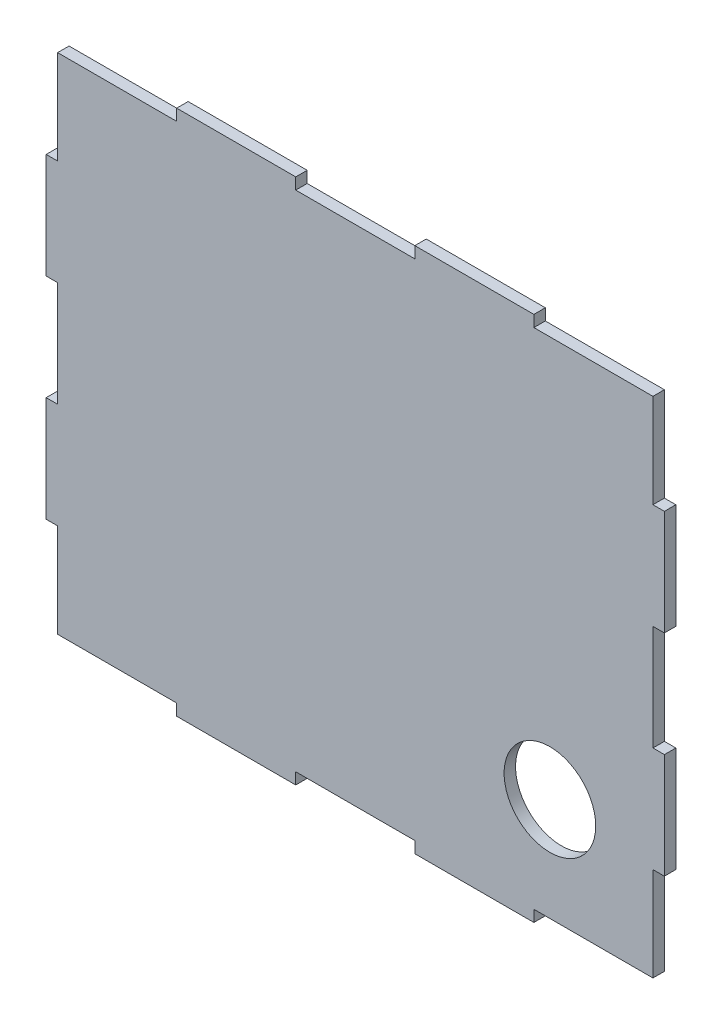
ISO-10303-21;
HEADER;
FILE_DESCRIPTION(('STEP AP214'),'2;1');
FILE_NAME('part.step','',(''),(''),'','','');
FILE_SCHEMA(('AUTOMOTIVE_DESIGN { 1 0 10303 214 1 1 1 1 }'));
ENDSEC;
DATA;
#1=APPLICATION_CONTEXT('core data for automotive mechanical design processes');
#2=APPLICATION_PROTOCOL_DEFINITION('international standard','automotive_design',2000,#1);
#3=PRODUCT_CONTEXT('',#1,'mechanical');
#4=PRODUCT('Part','Part','',(#3));
#5=PRODUCT_RELATED_PRODUCT_CATEGORY('part','',(#4));
#6=PRODUCT_DEFINITION_FORMATION('','',#4);
#7=PRODUCT_DEFINITION_CONTEXT('part definition',#1,'design');
#8=PRODUCT_DEFINITION('design','',#6,#7);
#9=PRODUCT_DEFINITION_SHAPE('','',#8);
#10=(LENGTH_UNIT() NAMED_UNIT(*) SI_UNIT(.MILLI.,.METRE.));
#11=(NAMED_UNIT(*) PLANE_ANGLE_UNIT() SI_UNIT($,.RADIAN.));
#12=(NAMED_UNIT(*) SI_UNIT($,.STERADIAN.) SOLID_ANGLE_UNIT());
#13=UNCERTAINTY_MEASURE_WITH_UNIT(LENGTH_MEASURE(1.E-05),#10,'distance_accuracy_value','');
#14=(GEOMETRIC_REPRESENTATION_CONTEXT(3) GLOBAL_UNCERTAINTY_ASSIGNED_CONTEXT((#13)) GLOBAL_UNIT_ASSIGNED_CONTEXT((#10,
#11,#12)) REPRESENTATION_CONTEXT('',''));
#15=CARTESIAN_POINT('',(0.,0.,0.));
#16=DIRECTION('',(0.,0.,1.));
#17=DIRECTION('',(1.,0.,0.));
#18=AXIS2_PLACEMENT_3D('',#15,#16,#17);
#19=CARTESIAN_POINT('',(3.175,143.234833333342,3.175));
#20=DIRECTION('',(0.,1.,0.));
#21=DIRECTION('',(0.,0.,1.));
#22=AXIS2_PLACEMENT_3D('',#19,#20,#21);
#23=PLANE('',#22);
#24=DIRECTION('',(1.,0.,0.));
#25=VECTOR('',#24,1.);
#26=CARTESIAN_POINT('',(3.175,143.234833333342,0.));
#27=LINE('',#26,#25);
#28=CARTESIAN_POINT('',(3.175,143.234833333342,0.));
#29=VERTEX_POINT('',#28);
#30=CARTESIAN_POINT('',(36.195,143.234833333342,0.));
#31=VERTEX_POINT('',#30);
#32=EDGE_CURVE('E296',#29,#31,#27,.T.);
#33=ORIENTED_EDGE('',*,*,#32,.F.);
#34=DIRECTION('',(0.,0.,-1.));
#35=VECTOR('',#34,1.);
#36=CARTESIAN_POINT('',(3.175,143.234833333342,3.175));
#37=LINE('',#36,#35);
#38=CARTESIAN_POINT('',(3.175,143.234833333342,3.175));
#39=VERTEX_POINT('',#38);
#40=EDGE_CURVE('E11',#39,#29,#37,.T.);
#41=ORIENTED_EDGE('',*,*,#40,.F.);
#42=DIRECTION('',(1.,0.,0.));
#43=VECTOR('',#42,1.);
#44=CARTESIAN_POINT('',(3.175,143.234833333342,3.175));
#45=LINE('',#44,#43);
#46=CARTESIAN_POINT('',(36.195,143.234833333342,3.175));
#47=VERTEX_POINT('',#46);
#48=EDGE_CURVE('E401',#39,#47,#45,.T.);
#49=ORIENTED_EDGE('',*,*,#48,.T.);
#50=DIRECTION('',(0.,0.,-1.));
#51=VECTOR('',#50,1.);
#52=CARTESIAN_POINT('',(36.195,143.234833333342,3.175));
#53=LINE('',#52,#51);
#54=EDGE_CURVE('E34',#47,#31,#53,.T.);
#55=ORIENTED_EDGE('',*,*,#54,.T.);
#56=EDGE_LOOP('',(#33,#41,#49,#55));
#57=FACE_BOUND('',#56,.T.);
#58=ADVANCED_FACE('F31',(#57),#23,.T.);
#59=CARTESIAN_POINT('',(3.175,117.199833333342,3.175));
#60=DIRECTION('',(-1.,0.,0.));
#61=DIRECTION('',(0.,-1.,0.));
#62=AXIS2_PLACEMENT_3D('',#59,#60,#61);
#63=PLANE('',#62);
#64=DIRECTION('',(0.,1.,0.));
#65=VECTOR('',#64,1.);
#66=CARTESIAN_POINT('',(3.175,117.199833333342,0.));
#67=LINE('',#66,#65);
#68=CARTESIAN_POINT('',(3.175,117.199833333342,0.));
#69=VERTEX_POINT('',#68);
#70=EDGE_CURVE('E399',#69,#29,#67,.T.);
#71=ORIENTED_EDGE('',*,*,#70,.F.);
#72=DIRECTION('',(0.,0.,-1.));
#73=VECTOR('',#72,1.);
#74=CARTESIAN_POINT('',(3.175,117.199833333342,3.175));
#75=LINE('',#74,#73);
#76=CARTESIAN_POINT('',(3.175,117.199833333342,3.175));
#77=VERTEX_POINT('',#76);
#78=EDGE_CURVE('E40',#77,#69,#75,.T.);
#79=ORIENTED_EDGE('',*,*,#78,.F.);
#80=DIRECTION('',(0.,1.,0.));
#81=VECTOR('',#80,1.);
#82=CARTESIAN_POINT('',(3.175,117.199833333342,3.175));
#83=LINE('',#82,#81);
#84=EDGE_CURVE('E286',#77,#39,#83,.T.);
#85=ORIENTED_EDGE('',*,*,#84,.T.);
#86=ORIENTED_EDGE('',*,*,#40,.T.);
#87=EDGE_LOOP('',(#71,#79,#85,#86));
#88=FACE_BOUND('',#87,.T.);
#89=ADVANCED_FACE('F469',(#88),#63,.T.);
#90=CARTESIAN_POINT('',(0.,117.199833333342,3.175));
#91=DIRECTION('',(0.,1.,0.));
#92=DIRECTION('',(0.,0.,1.));
#93=AXIS2_PLACEMENT_3D('',#90,#91,#92);
#94=PLANE('',#93);
#95=DIRECTION('',(1.,0.,0.));
#96=VECTOR('',#95,1.);
#97=CARTESIAN_POINT('',(0.,117.199833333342,0.));
#98=LINE('',#97,#96);
#99=CARTESIAN_POINT('',(0.,117.199833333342,0.));
#100=VERTEX_POINT('',#99);
#101=EDGE_CURVE('E273',#100,#69,#98,.T.);
#102=ORIENTED_EDGE('',*,*,#101,.F.);
#103=DIRECTION('',(0.,0.,-1.));
#104=VECTOR('',#103,1.);
#105=CARTESIAN_POINT('',(0.,117.199833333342,3.175));
#106=LINE('',#105,#104);
#107=CARTESIAN_POINT('',(0.,117.199833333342,3.175));
#108=VERTEX_POINT('',#107);
#109=EDGE_CURVE('E268',#108,#100,#106,.T.);
#110=ORIENTED_EDGE('',*,*,#109,.F.);
#111=DIRECTION('',(1.,0.,0.));
#112=VECTOR('',#111,1.);
#113=CARTESIAN_POINT('',(0.,117.199833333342,3.175));
#114=LINE('',#113,#112);
#115=EDGE_CURVE('E271',#108,#77,#114,.T.);
#116=ORIENTED_EDGE('',*,*,#115,.T.);
#117=ORIENTED_EDGE('',*,*,#78,.T.);
#118=EDGE_LOOP('',(#102,#110,#116,#117));
#119=FACE_BOUND('',#118,.T.);
#120=ADVANCED_FACE('F270',(#119),#94,.T.);
#121=CARTESIAN_POINT('',(0.,87.9898333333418,3.175));
#122=DIRECTION('',(-1.,0.,0.));
#123=DIRECTION('',(0.,0.,1.));
#124=AXIS2_PLACEMENT_3D('',#121,#122,#123);
#125=PLANE('',#124);
#126=DIRECTION('',(0.,1.,0.));
#127=VECTOR('',#126,1.);
#128=CARTESIAN_POINT('',(0.,87.9898333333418,0.));
#129=LINE('',#128,#127);
#130=CARTESIAN_POINT('',(0.,87.9898333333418,0.));
#131=VERTEX_POINT('',#130);
#132=EDGE_CURVE('E396',#131,#100,#129,.T.);
#133=ORIENTED_EDGE('',*,*,#132,.F.);
#134=DIRECTION('',(0.,0.,-1.));
#135=VECTOR('',#134,1.);
#136=CARTESIAN_POINT('',(0.,87.9898333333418,3.175));
#137=LINE('',#136,#135);
#138=CARTESIAN_POINT('',(0.,87.9898333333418,3.175));
#139=VERTEX_POINT('',#138);
#140=EDGE_CURVE('E278',#139,#131,#137,.T.);
#141=ORIENTED_EDGE('',*,*,#140,.F.);
#142=DIRECTION('',(0.,1.,0.));
#143=VECTOR('',#142,1.);
#144=CARTESIAN_POINT('',(0.,87.9898333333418,3.175));
#145=LINE('',#144,#143);
#146=EDGE_CURVE('E284',#139,#108,#145,.T.);
#147=ORIENTED_EDGE('',*,*,#146,.T.);
#148=ORIENTED_EDGE('',*,*,#109,.T.);
#149=EDGE_LOOP('',(#133,#141,#147,#148));
#150=FACE_BOUND('',#149,.T.);
#151=ADVANCED_FACE('F288',(#150),#125,.T.);
#152=CARTESIAN_POINT('',(3.175,87.9898333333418,3.175));
#153=DIRECTION('',(0.,-1.,0.));
#154=DIRECTION('',(0.,0.,-1.));
#155=AXIS2_PLACEMENT_3D('',#152,#153,#154);
#156=PLANE('',#155);
#157=DIRECTION('',(-1.,0.,0.));
#158=VECTOR('',#157,1.);
#159=CARTESIAN_POINT('',(3.175,87.9898333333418,0.));
#160=LINE('',#159,#158);
#161=CARTESIAN_POINT('',(3.175,87.9898333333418,0.));
#162=VERTEX_POINT('',#161);
#163=EDGE_CURVE('E393',#162,#131,#160,.T.);
#164=ORIENTED_EDGE('',*,*,#163,.F.);
#165=DIRECTION('',(0.,0.,-1.));
#166=VECTOR('',#165,1.);
#167=CARTESIAN_POINT('',(3.175,87.9898333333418,3.175));
#168=LINE('',#167,#166);
#169=CARTESIAN_POINT('',(3.175,87.9898333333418,3.175));
#170=VERTEX_POINT('',#169);
#171=EDGE_CURVE('E405',#170,#162,#168,.T.);
#172=ORIENTED_EDGE('',*,*,#171,.F.);
#173=DIRECTION('',(-1.,0.,0.));
#174=VECTOR('',#173,1.);
#175=CARTESIAN_POINT('',(3.175,87.9898333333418,3.175));
#176=LINE('',#175,#174);
#177=EDGE_CURVE('E289',#170,#139,#176,.T.);
#178=ORIENTED_EDGE('',*,*,#177,.T.);
#179=ORIENTED_EDGE('',*,*,#140,.T.);
#180=EDGE_LOOP('',(#164,#172,#178,#179));
#181=FACE_BOUND('',#180,.T.);
#182=ADVANCED_FACE('F482',(#181),#156,.T.);
#183=CARTESIAN_POINT('',(3.175,58.7798333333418,3.175));
#184=DIRECTION('',(-1.,0.,0.));
#185=DIRECTION('',(0.,0.,1.));
#186=AXIS2_PLACEMENT_3D('',#183,#184,#185);
#187=PLANE('',#186);
#188=DIRECTION('',(0.,1.,0.));
#189=VECTOR('',#188,1.);
#190=CARTESIAN_POINT('',(3.175,58.7798333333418,0.));
#191=LINE('',#190,#189);
#192=CARTESIAN_POINT('',(3.175,58.7798333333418,0.));
#193=VERTEX_POINT('',#192);
#194=EDGE_CURVE('E390',#193,#162,#191,.T.);
#195=ORIENTED_EDGE('',*,*,#194,.F.);
#196=DIRECTION('',(0.,0.,-1.));
#197=VECTOR('',#196,1.);
#198=CARTESIAN_POINT('',(3.175,58.7798333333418,3.175));
#199=LINE('',#198,#197);
#200=CARTESIAN_POINT('',(3.175,58.7798333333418,3.175));
#201=VERTEX_POINT('',#200);
#202=EDGE_CURVE('E407',#201,#193,#199,.T.);
#203=ORIENTED_EDGE('',*,*,#202,.F.);
#204=DIRECTION('',(0.,1.,0.));
#205=VECTOR('',#204,1.);
#206=CARTESIAN_POINT('',(3.175,58.7798333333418,3.175));
#207=LINE('',#206,#205);
#208=EDGE_CURVE('E291',#201,#170,#207,.T.);
#209=ORIENTED_EDGE('',*,*,#208,.T.);
#210=ORIENTED_EDGE('',*,*,#171,.T.);
#211=EDGE_LOOP('',(#195,#203,#209,#210));
#212=FACE_BOUND('',#211,.T.);
#213=ADVANCED_FACE('F485',(#212),#187,.T.);
#214=CARTESIAN_POINT('',(0.,58.7798333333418,3.175));
#215=DIRECTION('',(0.,1.,0.));
#216=DIRECTION('',(0.,0.,1.));
#217=AXIS2_PLACEMENT_3D('',#214,#215,#216);
#218=PLANE('',#217);
#219=DIRECTION('',(1.,0.,0.));
#220=VECTOR('',#219,1.);
#221=CARTESIAN_POINT('',(0.,58.7798333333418,0.));
#222=LINE('',#221,#220);
#223=CARTESIAN_POINT('',(0.,58.7798333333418,0.));
#224=VERTEX_POINT('',#223);
#225=EDGE_CURVE('E387',#224,#193,#222,.T.);
#226=ORIENTED_EDGE('',*,*,#225,.F.);
#227=DIRECTION('',(0.,0.,-1.));
#228=VECTOR('',#227,1.);
#229=CARTESIAN_POINT('',(0.,58.7798333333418,3.175));
#230=LINE('',#229,#228);
#231=CARTESIAN_POINT('',(0.,58.7798333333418,3.175));
#232=VERTEX_POINT('',#231);
#233=EDGE_CURVE('E409',#232,#224,#230,.T.);
#234=ORIENTED_EDGE('',*,*,#233,.F.);
#235=DIRECTION('',(1.,0.,0.));
#236=VECTOR('',#235,1.);
#237=CARTESIAN_POINT('',(0.,58.7798333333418,3.175));
#238=LINE('',#237,#236);
#239=EDGE_CURVE('E716',#232,#201,#238,.T.);
#240=ORIENTED_EDGE('',*,*,#239,.T.);
#241=ORIENTED_EDGE('',*,*,#202,.T.);
#242=EDGE_LOOP('',(#226,#234,#240,#241));
#243=FACE_BOUND('',#242,.T.);
#244=ADVANCED_FACE('F489',(#243),#218,.T.);
#245=CARTESIAN_POINT('',(0.,29.5698333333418,3.175));
#246=DIRECTION('',(-1.,0.,0.));
#247=DIRECTION('',(0.,0.,1.));
#248=AXIS2_PLACEMENT_3D('',#245,#246,#247);
#249=PLANE('',#248);
#250=DIRECTION('',(0.,1.,0.));
#251=VECTOR('',#250,1.);
#252=CARTESIAN_POINT('',(0.,29.5698333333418,0.));
#253=LINE('',#252,#251);
#254=CARTESIAN_POINT('',(0.,29.5698333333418,0.));
#255=VERTEX_POINT('',#254);
#256=EDGE_CURVE('E384',#255,#224,#253,.T.);
#257=ORIENTED_EDGE('',*,*,#256,.F.);
#258=DIRECTION('',(0.,0.,-1.));
#259=VECTOR('',#258,1.);
#260=CARTESIAN_POINT('',(0.,29.5698333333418,3.175));
#261=LINE('',#260,#259);
#262=CARTESIAN_POINT('',(0.,29.5698333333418,3.175));
#263=VERTEX_POINT('',#262);
#264=EDGE_CURVE('E411',#263,#255,#261,.T.);
#265=ORIENTED_EDGE('',*,*,#264,.F.);
#266=DIRECTION('',(0.,1.,0.));
#267=VECTOR('',#266,1.);
#268=CARTESIAN_POINT('',(0.,29.5698333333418,3.175));
#269=LINE('',#268,#267);
#270=EDGE_CURVE('E713',#263,#232,#269,.T.);
#271=ORIENTED_EDGE('',*,*,#270,.T.);
#272=ORIENTED_EDGE('',*,*,#233,.T.);
#273=EDGE_LOOP('',(#257,#265,#271,#272));
#274=FACE_BOUND('',#273,.T.);
#275=ADVANCED_FACE('F493',(#274),#249,.T.);
#276=CARTESIAN_POINT('',(3.175,29.5698333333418,3.175));
#277=DIRECTION('',(0.,-1.,0.));
#278=DIRECTION('',(0.,0.,-1.));
#279=AXIS2_PLACEMENT_3D('',#276,#277,#278);
#280=PLANE('',#279);
#281=DIRECTION('',(-1.,0.,0.));
#282=VECTOR('',#281,1.);
#283=CARTESIAN_POINT('',(3.175,29.5698333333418,0.));
#284=LINE('',#283,#282);
#285=CARTESIAN_POINT('',(3.175,29.5698333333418,0.));
#286=VERTEX_POINT('',#285);
#287=EDGE_CURVE('E381',#286,#255,#284,.T.);
#288=ORIENTED_EDGE('',*,*,#287,.F.);
#289=DIRECTION('',(0.,0.,-1.));
#290=VECTOR('',#289,1.);
#291=CARTESIAN_POINT('',(3.175,29.5698333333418,3.175));
#292=LINE('',#291,#290);
#293=CARTESIAN_POINT('',(3.175,29.5698333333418,3.175));
#294=VERTEX_POINT('',#293);
#295=EDGE_CURVE('E413',#294,#286,#292,.T.);
#296=ORIENTED_EDGE('',*,*,#295,.F.);
#297=DIRECTION('',(-1.,0.,0.));
#298=VECTOR('',#297,1.);
#299=CARTESIAN_POINT('',(3.175,29.5698333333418,3.175));
#300=LINE('',#299,#298);
#301=EDGE_CURVE('E710',#294,#263,#300,.T.);
#302=ORIENTED_EDGE('',*,*,#301,.T.);
#303=ORIENTED_EDGE('',*,*,#264,.T.);
#304=EDGE_LOOP('',(#288,#296,#302,#303));
#305=FACE_BOUND('',#304,.T.);
#306=ADVANCED_FACE('F497',(#305),#280,.T.);
#307=CARTESIAN_POINT('',(3.175,3.53483333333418,3.175));
#308=DIRECTION('',(-1.,0.,0.));
#309=DIRECTION('',(0.,0.,1.));
#310=AXIS2_PLACEMENT_3D('',#307,#308,#309);
#311=PLANE('',#310);
#312=DIRECTION('',(0.,1.,0.));
#313=VECTOR('',#312,1.);
#314=CARTESIAN_POINT('',(3.175,3.53483333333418,0.));
#315=LINE('',#314,#313);
#316=CARTESIAN_POINT('',(3.175,3.53483333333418,0.));
#317=VERTEX_POINT('',#316);
#318=EDGE_CURVE('E378',#317,#286,#315,.T.);
#319=ORIENTED_EDGE('',*,*,#318,.F.);
#320=DIRECTION('',(0.,0.,-1.));
#321=VECTOR('',#320,1.);
#322=CARTESIAN_POINT('',(3.175,3.53483333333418,3.175));
#323=LINE('',#322,#321);
#324=CARTESIAN_POINT('',(3.175,3.53483333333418,3.175));
#325=VERTEX_POINT('',#324);
#326=EDGE_CURVE('E415',#325,#317,#323,.T.);
#327=ORIENTED_EDGE('',*,*,#326,.F.);
#328=DIRECTION('',(0.,1.,0.));
#329=VECTOR('',#328,1.);
#330=CARTESIAN_POINT('',(3.175,3.53483333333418,3.175));
#331=LINE('',#330,#329);
#332=EDGE_CURVE('E707',#325,#294,#331,.T.);
#333=ORIENTED_EDGE('',*,*,#332,.T.);
#334=ORIENTED_EDGE('',*,*,#295,.T.);
#335=EDGE_LOOP('',(#319,#327,#333,#334));
#336=FACE_BOUND('',#335,.T.);
#337=ADVANCED_FACE('F501',(#336),#311,.T.);
#338=CARTESIAN_POINT('',(36.195,3.53483333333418,3.175));
#339=DIRECTION('',(0.,-1.,0.));
#340=DIRECTION('',(1.,0.,0.));
#341=AXIS2_PLACEMENT_3D('',#338,#339,#340);
#342=PLANE('',#341);
#343=DIRECTION('',(-1.,0.,0.));
#344=VECTOR('',#343,1.);
#345=CARTESIAN_POINT('',(36.195,3.53483333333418,0.));
#346=LINE('',#345,#344);
#347=CARTESIAN_POINT('',(36.195,3.53483333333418,0.));
#348=VERTEX_POINT('',#347);
#349=EDGE_CURVE('E375',#348,#317,#346,.T.);
#350=ORIENTED_EDGE('',*,*,#349,.F.);
#351=DIRECTION('',(0.,0.,-1.));
#352=VECTOR('',#351,1.);
#353=CARTESIAN_POINT('',(36.195,3.53483333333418,3.175));
#354=LINE('',#353,#352);
#355=CARTESIAN_POINT('',(36.195,3.53483333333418,3.175));
#356=VERTEX_POINT('',#355);
#357=EDGE_CURVE('E417',#356,#348,#354,.T.);
#358=ORIENTED_EDGE('',*,*,#357,.F.);
#359=DIRECTION('',(-1.,0.,0.));
#360=VECTOR('',#359,1.);
#361=CARTESIAN_POINT('',(36.195,3.53483333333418,3.175));
#362=LINE('',#361,#360);
#363=EDGE_CURVE('E704',#356,#325,#362,.T.);
#364=ORIENTED_EDGE('',*,*,#363,.T.);
#365=ORIENTED_EDGE('',*,*,#326,.T.);
#366=EDGE_LOOP('',(#350,#358,#364,#365));
#367=FACE_BOUND('',#366,.T.);
#368=ADVANCED_FACE('F505',(#367),#342,.T.);
#369=CARTESIAN_POINT('',(36.195,0.359833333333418,3.175));
#370=DIRECTION('',(-1.,0.,0.));
#371=DIRECTION('',(0.,0.,1.));
#372=AXIS2_PLACEMENT_3D('',#369,#370,#371);
#373=PLANE('',#372);
#374=DIRECTION('',(0.,1.,0.));
#375=VECTOR('',#374,1.);
#376=CARTESIAN_POINT('',(36.195,0.359833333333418,0.));
#377=LINE('',#376,#375);
#378=CARTESIAN_POINT('',(36.195,0.359833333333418,0.));
#379=VERTEX_POINT('',#378);
#380=EDGE_CURVE('E372',#379,#348,#377,.T.);
#381=ORIENTED_EDGE('',*,*,#380,.F.);
#382=DIRECTION('',(0.,0.,-1.));
#383=VECTOR('',#382,1.);
#384=CARTESIAN_POINT('',(36.195,0.359833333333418,3.175));
#385=LINE('',#384,#383);
#386=CARTESIAN_POINT('',(36.195,0.359833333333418,3.175));
#387=VERTEX_POINT('',#386);
#388=EDGE_CURVE('E419',#387,#379,#385,.T.);
#389=ORIENTED_EDGE('',*,*,#388,.F.);
#390=DIRECTION('',(0.,1.,0.));
#391=VECTOR('',#390,1.);
#392=CARTESIAN_POINT('',(36.195,0.359833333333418,3.175));
#393=LINE('',#392,#391);
#394=EDGE_CURVE('E701',#387,#356,#393,.T.);
#395=ORIENTED_EDGE('',*,*,#394,.T.);
#396=ORIENTED_EDGE('',*,*,#357,.T.);
#397=EDGE_LOOP('',(#381,#389,#395,#396));
#398=FACE_BOUND('',#397,.T.);
#399=ADVANCED_FACE('F509',(#398),#373,.T.);
#400=CARTESIAN_POINT('',(69.215,0.359833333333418,3.175));
#401=DIRECTION('',(0.,-1.,0.));
#402=DIRECTION('',(1.,0.,0.));
#403=AXIS2_PLACEMENT_3D('',#400,#401,#402);
#404=PLANE('',#403);
#405=DIRECTION('',(-1.,0.,0.));
#406=VECTOR('',#405,1.);
#407=CARTESIAN_POINT('',(69.215,0.359833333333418,0.));
#408=LINE('',#407,#406);
#409=CARTESIAN_POINT('',(69.215,0.359833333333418,0.));
#410=VERTEX_POINT('',#409);
#411=EDGE_CURVE('E369',#410,#379,#408,.T.);
#412=ORIENTED_EDGE('',*,*,#411,.F.);
#413=DIRECTION('',(0.,0.,-1.));
#414=VECTOR('',#413,1.);
#415=CARTESIAN_POINT('',(69.215,0.359833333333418,3.175));
#416=LINE('',#415,#414);
#417=CARTESIAN_POINT('',(69.215,0.359833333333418,3.175));
#418=VERTEX_POINT('',#417);
#419=EDGE_CURVE('E421',#418,#410,#416,.T.);
#420=ORIENTED_EDGE('',*,*,#419,.F.);
#421=DIRECTION('',(-1.,0.,0.));
#422=VECTOR('',#421,1.);
#423=CARTESIAN_POINT('',(69.215,0.359833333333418,3.175));
#424=LINE('',#423,#422);
#425=EDGE_CURVE('E698',#418,#387,#424,.T.);
#426=ORIENTED_EDGE('',*,*,#425,.T.);
#427=ORIENTED_EDGE('',*,*,#388,.T.);
#428=EDGE_LOOP('',(#412,#420,#426,#427));
#429=FACE_BOUND('',#428,.T.);
#430=ADVANCED_FACE('F513',(#429),#404,.T.);
#431=CARTESIAN_POINT('',(69.215,3.53483333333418,3.175));
#432=DIRECTION('',(1.,0.,0.));
#433=DIRECTION('',(0.,0.,-1.));
#434=AXIS2_PLACEMENT_3D('',#431,#432,#433);
#435=PLANE('',#434);
#436=DIRECTION('',(0.,-1.,0.));
#437=VECTOR('',#436,1.);
#438=CARTESIAN_POINT('',(69.215,3.53483333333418,0.));
#439=LINE('',#438,#437);
#440=CARTESIAN_POINT('',(69.215,3.53483333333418,0.));
#441=VERTEX_POINT('',#440);
#442=EDGE_CURVE('E366',#441,#410,#439,.T.);
#443=ORIENTED_EDGE('',*,*,#442,.F.);
#444=DIRECTION('',(0.,0.,-1.));
#445=VECTOR('',#444,1.);
#446=CARTESIAN_POINT('',(69.215,3.53483333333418,3.175));
#447=LINE('',#446,#445);
#448=CARTESIAN_POINT('',(69.215,3.53483333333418,3.175));
#449=VERTEX_POINT('',#448);
#450=EDGE_CURVE('E423',#449,#441,#447,.T.);
#451=ORIENTED_EDGE('',*,*,#450,.F.);
#452=DIRECTION('',(0.,-1.,0.));
#453=VECTOR('',#452,1.);
#454=CARTESIAN_POINT('',(69.215,3.53483333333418,3.175));
#455=LINE('',#454,#453);
#456=EDGE_CURVE('E695',#449,#418,#455,.T.);
#457=ORIENTED_EDGE('',*,*,#456,.T.);
#458=ORIENTED_EDGE('',*,*,#419,.T.);
#459=EDGE_LOOP('',(#443,#451,#457,#458));
#460=FACE_BOUND('',#459,.T.);
#461=ADVANCED_FACE('F517',(#460),#435,.T.);
#462=CARTESIAN_POINT('',(102.235,3.53483333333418,3.175));
#463=DIRECTION('',(0.,-1.,0.));
#464=DIRECTION('',(0.,0.,-1.));
#465=AXIS2_PLACEMENT_3D('',#462,#463,#464);
#466=PLANE('',#465);
#467=DIRECTION('',(-1.,0.,0.));
#468=VECTOR('',#467,1.);
#469=CARTESIAN_POINT('',(102.235,3.53483333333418,0.));
#470=LINE('',#469,#468);
#471=CARTESIAN_POINT('',(102.235,3.53483333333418,0.));
#472=VERTEX_POINT('',#471);
#473=EDGE_CURVE('E363',#472,#441,#470,.T.);
#474=ORIENTED_EDGE('',*,*,#473,.F.);
#475=DIRECTION('',(0.,0.,-1.));
#476=VECTOR('',#475,1.);
#477=CARTESIAN_POINT('',(102.235,3.53483333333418,3.175));
#478=LINE('',#477,#476);
#479=CARTESIAN_POINT('',(102.235,3.53483333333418,3.175));
#480=VERTEX_POINT('',#479);
#481=EDGE_CURVE('E425',#480,#472,#478,.T.);
#482=ORIENTED_EDGE('',*,*,#481,.F.);
#483=DIRECTION('',(-1.,0.,0.));
#484=VECTOR('',#483,1.);
#485=CARTESIAN_POINT('',(102.235,3.53483333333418,3.175));
#486=LINE('',#485,#484);
#487=EDGE_CURVE('E692',#480,#449,#486,.T.);
#488=ORIENTED_EDGE('',*,*,#487,.T.);
#489=ORIENTED_EDGE('',*,*,#450,.T.);
#490=EDGE_LOOP('',(#474,#482,#488,#489));
#491=FACE_BOUND('',#490,.T.);
#492=ADVANCED_FACE('F521',(#491),#466,.T.);
#493=CARTESIAN_POINT('',(102.235,0.359833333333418,3.175));
#494=DIRECTION('',(-1.,0.,0.));
#495=DIRECTION('',(0.,0.,1.));
#496=AXIS2_PLACEMENT_3D('',#493,#494,#495);
#497=PLANE('',#496);
#498=DIRECTION('',(0.,1.,0.));
#499=VECTOR('',#498,1.);
#500=CARTESIAN_POINT('',(102.235,0.359833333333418,0.));
#501=LINE('',#500,#499);
#502=CARTESIAN_POINT('',(102.235,0.359833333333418,0.));
#503=VERTEX_POINT('',#502);
#504=EDGE_CURVE('E360',#503,#472,#501,.T.);
#505=ORIENTED_EDGE('',*,*,#504,.F.);
#506=DIRECTION('',(0.,0.,-1.));
#507=VECTOR('',#506,1.);
#508=CARTESIAN_POINT('',(102.235,0.359833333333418,3.175));
#509=LINE('',#508,#507);
#510=CARTESIAN_POINT('',(102.235,0.359833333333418,3.175));
#511=VERTEX_POINT('',#510);
#512=EDGE_CURVE('E427',#511,#503,#509,.T.);
#513=ORIENTED_EDGE('',*,*,#512,.F.);
#514=DIRECTION('',(0.,1.,0.));
#515=VECTOR('',#514,1.);
#516=CARTESIAN_POINT('',(102.235,0.359833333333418,3.175));
#517=LINE('',#516,#515);
#518=EDGE_CURVE('E689',#511,#480,#517,.T.);
#519=ORIENTED_EDGE('',*,*,#518,.T.);
#520=ORIENTED_EDGE('',*,*,#481,.T.);
#521=EDGE_LOOP('',(#505,#513,#519,#520));
#522=FACE_BOUND('',#521,.T.);
#523=ADVANCED_FACE('F525',(#522),#497,.T.);
#524=CARTESIAN_POINT('',(135.255,0.359833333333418,3.175));
#525=DIRECTION('',(0.,-1.,0.));
#526=DIRECTION('',(1.,0.,0.));
#527=AXIS2_PLACEMENT_3D('',#524,#525,#526);
#528=PLANE('',#527);
#529=DIRECTION('',(-1.,0.,0.));
#530=VECTOR('',#529,1.);
#531=CARTESIAN_POINT('',(135.255,0.359833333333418,0.));
#532=LINE('',#531,#530);
#533=CARTESIAN_POINT('',(135.255,0.359833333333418,0.));
#534=VERTEX_POINT('',#533);
#535=EDGE_CURVE('E357',#534,#503,#532,.T.);
#536=ORIENTED_EDGE('',*,*,#535,.F.);
#537=DIRECTION('',(0.,0.,-1.));
#538=VECTOR('',#537,1.);
#539=CARTESIAN_POINT('',(135.255,0.359833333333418,3.175));
#540=LINE('',#539,#538);
#541=CARTESIAN_POINT('',(135.255,0.359833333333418,3.175));
#542=VERTEX_POINT('',#541);
#543=EDGE_CURVE('E429',#542,#534,#540,.T.);
#544=ORIENTED_EDGE('',*,*,#543,.F.);
#545=DIRECTION('',(-1.,0.,0.));
#546=VECTOR('',#545,1.);
#547=CARTESIAN_POINT('',(135.255,0.359833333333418,3.175));
#548=LINE('',#547,#546);
#549=EDGE_CURVE('E686',#542,#511,#548,.T.);
#550=ORIENTED_EDGE('',*,*,#549,.T.);
#551=ORIENTED_EDGE('',*,*,#512,.T.);
#552=EDGE_LOOP('',(#536,#544,#550,#551));
#553=FACE_BOUND('',#552,.T.);
#554=ADVANCED_FACE('F529',(#553),#528,.T.);
#555=CARTESIAN_POINT('',(135.255,3.53483333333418,3.175));
#556=DIRECTION('',(1.,0.,0.));
#557=DIRECTION('',(0.,0.,-1.));
#558=AXIS2_PLACEMENT_3D('',#555,#556,#557);
#559=PLANE('',#558);
#560=DIRECTION('',(0.,-1.,0.));
#561=VECTOR('',#560,1.);
#562=CARTESIAN_POINT('',(135.255,3.53483333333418,0.));
#563=LINE('',#562,#561);
#564=CARTESIAN_POINT('',(135.255,3.53483333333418,0.));
#565=VERTEX_POINT('',#564);
#566=EDGE_CURVE('E354',#565,#534,#563,.T.);
#567=ORIENTED_EDGE('',*,*,#566,.F.);
#568=DIRECTION('',(0.,0.,-1.));
#569=VECTOR('',#568,1.);
#570=CARTESIAN_POINT('',(135.255,3.53483333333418,3.175));
#571=LINE('',#570,#569);
#572=CARTESIAN_POINT('',(135.255,3.53483333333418,3.175));
#573=VERTEX_POINT('',#572);
#574=EDGE_CURVE('E431',#573,#565,#571,.T.);
#575=ORIENTED_EDGE('',*,*,#574,.F.);
#576=DIRECTION('',(0.,-1.,0.));
#577=VECTOR('',#576,1.);
#578=CARTESIAN_POINT('',(135.255,3.53483333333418,3.175));
#579=LINE('',#578,#577);
#580=EDGE_CURVE('E683',#573,#542,#579,.T.);
#581=ORIENTED_EDGE('',*,*,#580,.T.);
#582=ORIENTED_EDGE('',*,*,#543,.T.);
#583=EDGE_LOOP('',(#567,#575,#581,#582));
#584=FACE_BOUND('',#583,.T.);
#585=ADVANCED_FACE('F533',(#584),#559,.T.);
#586=CARTESIAN_POINT('',(168.275,3.53483333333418,3.175));
#587=DIRECTION('',(0.,-1.,0.));
#588=DIRECTION('',(0.,0.,-1.));
#589=AXIS2_PLACEMENT_3D('',#586,#587,#588);
#590=PLANE('',#589);
#591=DIRECTION('',(-1.,0.,0.));
#592=VECTOR('',#591,1.);
#593=CARTESIAN_POINT('',(168.275,3.53483333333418,0.));
#594=LINE('',#593,#592);
#595=CARTESIAN_POINT('',(168.275,3.53483333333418,0.));
#596=VERTEX_POINT('',#595);
#597=EDGE_CURVE('E351',#596,#565,#594,.T.);
#598=ORIENTED_EDGE('',*,*,#597,.F.);
#599=DIRECTION('',(0.,0.,-1.));
#600=VECTOR('',#599,1.);
#601=CARTESIAN_POINT('',(168.275,3.53483333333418,3.175));
#602=LINE('',#601,#600);
#603=CARTESIAN_POINT('',(168.275,3.53483333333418,3.175));
#604=VERTEX_POINT('',#603);
#605=EDGE_CURVE('E433',#604,#596,#602,.T.);
#606=ORIENTED_EDGE('',*,*,#605,.F.);
#607=DIRECTION('',(-1.,0.,0.));
#608=VECTOR('',#607,1.);
#609=CARTESIAN_POINT('',(168.275,3.53483333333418,3.175));
#610=LINE('',#609,#608);
#611=EDGE_CURVE('E680',#604,#573,#610,.T.);
#612=ORIENTED_EDGE('',*,*,#611,.T.);
#613=ORIENTED_EDGE('',*,*,#574,.T.);
#614=EDGE_LOOP('',(#598,#606,#612,#613));
#615=FACE_BOUND('',#614,.T.);
#616=ADVANCED_FACE('F537',(#615),#590,.T.);
#617=CARTESIAN_POINT('',(168.275,29.5698333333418,3.175));
#618=DIRECTION('',(1.,0.,0.));
#619=DIRECTION('',(0.,0.,-1.));
#620=AXIS2_PLACEMENT_3D('',#617,#618,#619);
#621=PLANE('',#620);
#622=DIRECTION('',(0.,-1.,0.));
#623=VECTOR('',#622,1.);
#624=CARTESIAN_POINT('',(168.275,29.5698333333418,0.));
#625=LINE('',#624,#623);
#626=CARTESIAN_POINT('',(168.275,29.5698333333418,0.));
#627=VERTEX_POINT('',#626);
#628=EDGE_CURVE('E348',#627,#596,#625,.T.);
#629=ORIENTED_EDGE('',*,*,#628,.F.);
#630=DIRECTION('',(0.,0.,-1.));
#631=VECTOR('',#630,1.);
#632=CARTESIAN_POINT('',(168.275,29.5698333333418,3.175));
#633=LINE('',#632,#631);
#634=CARTESIAN_POINT('',(168.275,29.5698333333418,3.175));
#635=VERTEX_POINT('',#634);
#636=EDGE_CURVE('E435',#635,#627,#633,.T.);
#637=ORIENTED_EDGE('',*,*,#636,.F.);
#638=DIRECTION('',(0.,-1.,0.));
#639=VECTOR('',#638,1.);
#640=CARTESIAN_POINT('',(168.275,29.5698333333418,3.175));
#641=LINE('',#640,#639);
#642=EDGE_CURVE('E677',#635,#604,#641,.T.);
#643=ORIENTED_EDGE('',*,*,#642,.T.);
#644=ORIENTED_EDGE('',*,*,#605,.T.);
#645=EDGE_LOOP('',(#629,#637,#643,#644));
#646=FACE_BOUND('',#645,.T.);
#647=ADVANCED_FACE('F541',(#646),#621,.T.);
#648=CARTESIAN_POINT('',(171.45,29.5698333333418,3.175));
#649=DIRECTION('',(0.,-1.,0.));
#650=DIRECTION('',(0.,0.,-1.));
#651=AXIS2_PLACEMENT_3D('',#648,#649,#650);
#652=PLANE('',#651);
#653=DIRECTION('',(-1.,0.,0.));
#654=VECTOR('',#653,1.);
#655=CARTESIAN_POINT('',(171.45,29.5698333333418,0.));
#656=LINE('',#655,#654);
#657=CARTESIAN_POINT('',(171.45,29.5698333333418,0.));
#658=VERTEX_POINT('',#657);
#659=EDGE_CURVE('E345',#658,#627,#656,.T.);
#660=ORIENTED_EDGE('',*,*,#659,.F.);
#661=DIRECTION('',(0.,0.,-1.));
#662=VECTOR('',#661,1.);
#663=CARTESIAN_POINT('',(171.45,29.5698333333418,3.175));
#664=LINE('',#663,#662);
#665=CARTESIAN_POINT('',(171.45,29.5698333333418,3.175));
#666=VERTEX_POINT('',#665);
#667=EDGE_CURVE('E437',#666,#658,#664,.T.);
#668=ORIENTED_EDGE('',*,*,#667,.F.);
#669=DIRECTION('',(-1.,0.,0.));
#670=VECTOR('',#669,1.);
#671=CARTESIAN_POINT('',(171.45,29.5698333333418,3.175));
#672=LINE('',#671,#670);
#673=EDGE_CURVE('E674',#666,#635,#672,.T.);
#674=ORIENTED_EDGE('',*,*,#673,.T.);
#675=ORIENTED_EDGE('',*,*,#636,.T.);
#676=EDGE_LOOP('',(#660,#668,#674,#675));
#677=FACE_BOUND('',#676,.T.);
#678=ADVANCED_FACE('F545',(#677),#652,.T.);
#679=CARTESIAN_POINT('',(171.45,58.7798333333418,3.175));
#680=DIRECTION('',(1.,0.,0.));
#681=DIRECTION('',(0.,0.,-1.));
#682=AXIS2_PLACEMENT_3D('',#679,#680,#681);
#683=PLANE('',#682);
#684=DIRECTION('',(0.,-1.,0.));
#685=VECTOR('',#684,1.);
#686=CARTESIAN_POINT('',(171.45,58.7798333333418,0.));
#687=LINE('',#686,#685);
#688=CARTESIAN_POINT('',(171.45,58.7798333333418,0.));
#689=VERTEX_POINT('',#688);
#690=EDGE_CURVE('E342',#689,#658,#687,.T.);
#691=ORIENTED_EDGE('',*,*,#690,.F.);
#692=DIRECTION('',(0.,0.,-1.));
#693=VECTOR('',#692,1.);
#694=CARTESIAN_POINT('',(171.45,58.7798333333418,3.175));
#695=LINE('',#694,#693);
#696=CARTESIAN_POINT('',(171.45,58.7798333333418,3.175));
#697=VERTEX_POINT('',#696);
#698=EDGE_CURVE('E439',#697,#689,#695,.T.);
#699=ORIENTED_EDGE('',*,*,#698,.F.);
#700=DIRECTION('',(0.,-1.,0.));
#701=VECTOR('',#700,1.);
#702=CARTESIAN_POINT('',(171.45,58.7798333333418,3.175));
#703=LINE('',#702,#701);
#704=EDGE_CURVE('E671',#697,#666,#703,.T.);
#705=ORIENTED_EDGE('',*,*,#704,.T.);
#706=ORIENTED_EDGE('',*,*,#667,.T.);
#707=EDGE_LOOP('',(#691,#699,#705,#706));
#708=FACE_BOUND('',#707,.T.);
#709=ADVANCED_FACE('F549',(#708),#683,.T.);
#710=CARTESIAN_POINT('',(168.275,58.7798333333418,3.175));
#711=DIRECTION('',(0.,1.,0.));
#712=DIRECTION('',(0.,0.,1.));
#713=AXIS2_PLACEMENT_3D('',#710,#711,#712);
#714=PLANE('',#713);
#715=DIRECTION('',(1.,0.,0.));
#716=VECTOR('',#715,1.);
#717=CARTESIAN_POINT('',(168.275,58.7798333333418,0.));
#718=LINE('',#717,#716);
#719=CARTESIAN_POINT('',(168.275,58.7798333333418,0.));
#720=VERTEX_POINT('',#719);
#721=EDGE_CURVE('E339',#720,#689,#718,.T.);
#722=ORIENTED_EDGE('',*,*,#721,.F.);
#723=DIRECTION('',(0.,0.,-1.));
#724=VECTOR('',#723,1.);
#725=CARTESIAN_POINT('',(168.275,58.7798333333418,3.175));
#726=LINE('',#725,#724);
#727=CARTESIAN_POINT('',(168.275,58.7798333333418,3.175));
#728=VERTEX_POINT('',#727);
#729=EDGE_CURVE('E441',#728,#720,#726,.T.);
#730=ORIENTED_EDGE('',*,*,#729,.F.);
#731=DIRECTION('',(1.,0.,0.));
#732=VECTOR('',#731,1.);
#733=CARTESIAN_POINT('',(168.275,58.7798333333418,3.175));
#734=LINE('',#733,#732);
#735=EDGE_CURVE('E668',#728,#697,#734,.T.);
#736=ORIENTED_EDGE('',*,*,#735,.T.);
#737=ORIENTED_EDGE('',*,*,#698,.T.);
#738=EDGE_LOOP('',(#722,#730,#736,#737));
#739=FACE_BOUND('',#738,.T.);
#740=ADVANCED_FACE('F553',(#739),#714,.T.);
#741=CARTESIAN_POINT('',(168.275,87.9898333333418,3.175));
#742=DIRECTION('',(1.,0.,0.));
#743=DIRECTION('',(0.,0.,-1.));
#744=AXIS2_PLACEMENT_3D('',#741,#742,#743);
#745=PLANE('',#744);
#746=DIRECTION('',(0.,-1.,0.));
#747=VECTOR('',#746,1.);
#748=CARTESIAN_POINT('',(168.275,87.9898333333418,0.));
#749=LINE('',#748,#747);
#750=CARTESIAN_POINT('',(168.275,87.9898333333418,0.));
#751=VERTEX_POINT('',#750);
#752=EDGE_CURVE('E336',#751,#720,#749,.T.);
#753=ORIENTED_EDGE('',*,*,#752,.F.);
#754=DIRECTION('',(0.,0.,-1.));
#755=VECTOR('',#754,1.);
#756=CARTESIAN_POINT('',(168.275,87.9898333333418,3.175));
#757=LINE('',#756,#755);
#758=CARTESIAN_POINT('',(168.275,87.9898333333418,3.175));
#759=VERTEX_POINT('',#758);
#760=EDGE_CURVE('E443',#759,#751,#757,.T.);
#761=ORIENTED_EDGE('',*,*,#760,.F.);
#762=DIRECTION('',(0.,-1.,0.));
#763=VECTOR('',#762,1.);
#764=CARTESIAN_POINT('',(168.275,87.9898333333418,3.175));
#765=LINE('',#764,#763);
#766=EDGE_CURVE('E665',#759,#728,#765,.T.);
#767=ORIENTED_EDGE('',*,*,#766,.T.);
#768=ORIENTED_EDGE('',*,*,#729,.T.);
#769=EDGE_LOOP('',(#753,#761,#767,#768));
#770=FACE_BOUND('',#769,.T.);
#771=ADVANCED_FACE('F557',(#770),#745,.T.);
#772=CARTESIAN_POINT('',(171.45,87.9898333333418,3.175));
#773=DIRECTION('',(0.,-1.,0.));
#774=DIRECTION('',(0.,0.,-1.));
#775=AXIS2_PLACEMENT_3D('',#772,#773,#774);
#776=PLANE('',#775);
#777=DIRECTION('',(-1.,0.,0.));
#778=VECTOR('',#777,1.);
#779=CARTESIAN_POINT('',(171.45,87.9898333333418,0.));
#780=LINE('',#779,#778);
#781=CARTESIAN_POINT('',(171.45,87.9898333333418,0.));
#782=VERTEX_POINT('',#781);
#783=EDGE_CURVE('E333',#782,#751,#780,.T.);
#784=ORIENTED_EDGE('',*,*,#783,.F.);
#785=DIRECTION('',(0.,0.,-1.));
#786=VECTOR('',#785,1.);
#787=CARTESIAN_POINT('',(171.45,87.9898333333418,3.175));
#788=LINE('',#787,#786);
#789=CARTESIAN_POINT('',(171.45,87.9898333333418,3.175));
#790=VERTEX_POINT('',#789);
#791=EDGE_CURVE('E445',#790,#782,#788,.T.);
#792=ORIENTED_EDGE('',*,*,#791,.F.);
#793=DIRECTION('',(-1.,0.,0.));
#794=VECTOR('',#793,1.);
#795=CARTESIAN_POINT('',(171.45,87.9898333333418,3.175));
#796=LINE('',#795,#794);
#797=EDGE_CURVE('E662',#790,#759,#796,.T.);
#798=ORIENTED_EDGE('',*,*,#797,.T.);
#799=ORIENTED_EDGE('',*,*,#760,.T.);
#800=EDGE_LOOP('',(#784,#792,#798,#799));
#801=FACE_BOUND('',#800,.T.);
#802=ADVANCED_FACE('F561',(#801),#776,.T.);
#803=CARTESIAN_POINT('',(171.45,117.199833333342,3.175));
#804=DIRECTION('',(1.,0.,0.));
#805=DIRECTION('',(0.,0.,-1.));
#806=AXIS2_PLACEMENT_3D('',#803,#804,#805);
#807=PLANE('',#806);
#808=DIRECTION('',(0.,-1.,0.));
#809=VECTOR('',#808,1.);
#810=CARTESIAN_POINT('',(171.45,117.199833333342,0.));
#811=LINE('',#810,#809);
#812=CARTESIAN_POINT('',(171.45,117.199833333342,0.));
#813=VERTEX_POINT('',#812);
#814=EDGE_CURVE('E330',#813,#782,#811,.T.);
#815=ORIENTED_EDGE('',*,*,#814,.F.);
#816=DIRECTION('',(0.,0.,-1.));
#817=VECTOR('',#816,1.);
#818=CARTESIAN_POINT('',(171.45,117.199833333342,3.175));
#819=LINE('',#818,#817);
#820=CARTESIAN_POINT('',(171.45,117.199833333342,3.175));
#821=VERTEX_POINT('',#820);
#822=EDGE_CURVE('E447',#821,#813,#819,.T.);
#823=ORIENTED_EDGE('',*,*,#822,.F.);
#824=DIRECTION('',(0.,-1.,0.));
#825=VECTOR('',#824,1.);
#826=CARTESIAN_POINT('',(171.45,117.199833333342,3.175));
#827=LINE('',#826,#825);
#828=EDGE_CURVE('E659',#821,#790,#827,.T.);
#829=ORIENTED_EDGE('',*,*,#828,.T.);
#830=ORIENTED_EDGE('',*,*,#791,.T.);
#831=EDGE_LOOP('',(#815,#823,#829,#830));
#832=FACE_BOUND('',#831,.T.);
#833=ADVANCED_FACE('F565',(#832),#807,.T.);
#834=CARTESIAN_POINT('',(168.275,117.199833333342,3.175));
#835=DIRECTION('',(0.,1.,0.));
#836=DIRECTION('',(0.,0.,1.));
#837=AXIS2_PLACEMENT_3D('',#834,#835,#836);
#838=PLANE('',#837);
#839=DIRECTION('',(1.,0.,0.));
#840=VECTOR('',#839,1.);
#841=CARTESIAN_POINT('',(168.275,117.199833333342,0.));
#842=LINE('',#841,#840);
#843=CARTESIAN_POINT('',(168.275,117.199833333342,0.));
#844=VERTEX_POINT('',#843);
#845=EDGE_CURVE('E327',#844,#813,#842,.T.);
#846=ORIENTED_EDGE('',*,*,#845,.F.);
#847=DIRECTION('',(0.,0.,-1.));
#848=VECTOR('',#847,1.);
#849=CARTESIAN_POINT('',(168.275,117.199833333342,3.175));
#850=LINE('',#849,#848);
#851=CARTESIAN_POINT('',(168.275,117.199833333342,3.175));
#852=VERTEX_POINT('',#851);
#853=EDGE_CURVE('E449',#852,#844,#850,.T.);
#854=ORIENTED_EDGE('',*,*,#853,.F.);
#855=DIRECTION('',(1.,0.,0.));
#856=VECTOR('',#855,1.);
#857=CARTESIAN_POINT('',(168.275,117.199833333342,3.175));
#858=LINE('',#857,#856);
#859=EDGE_CURVE('E656',#852,#821,#858,.T.);
#860=ORIENTED_EDGE('',*,*,#859,.T.);
#861=ORIENTED_EDGE('',*,*,#822,.T.);
#862=EDGE_LOOP('',(#846,#854,#860,#861));
#863=FACE_BOUND('',#862,.T.);
#864=ADVANCED_FACE('F569',(#863),#838,.T.);
#865=CARTESIAN_POINT('',(168.275,143.234833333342,3.175));
#866=DIRECTION('',(1.,0.,0.));
#867=DIRECTION('',(0.,0.,-1.));
#868=AXIS2_PLACEMENT_3D('',#865,#866,#867);
#869=PLANE('',#868);
#870=DIRECTION('',(0.,-1.,0.));
#871=VECTOR('',#870,1.);
#872=CARTESIAN_POINT('',(168.275,143.234833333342,0.));
#873=LINE('',#872,#871);
#874=CARTESIAN_POINT('',(168.275,143.234833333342,0.));
#875=VERTEX_POINT('',#874);
#876=EDGE_CURVE('E324',#875,#844,#873,.T.);
#877=ORIENTED_EDGE('',*,*,#876,.F.);
#878=DIRECTION('',(0.,0.,-1.));
#879=VECTOR('',#878,1.);
#880=CARTESIAN_POINT('',(168.275,143.234833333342,3.175));
#881=LINE('',#880,#879);
#882=CARTESIAN_POINT('',(168.275,143.234833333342,3.175));
#883=VERTEX_POINT('',#882);
#884=EDGE_CURVE('E451',#883,#875,#881,.T.);
#885=ORIENTED_EDGE('',*,*,#884,.F.);
#886=DIRECTION('',(0.,-1.,0.));
#887=VECTOR('',#886,1.);
#888=CARTESIAN_POINT('',(168.275,143.234833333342,3.175));
#889=LINE('',#888,#887);
#890=EDGE_CURVE('E653',#883,#852,#889,.T.);
#891=ORIENTED_EDGE('',*,*,#890,.T.);
#892=ORIENTED_EDGE('',*,*,#853,.T.);
#893=EDGE_LOOP('',(#877,#885,#891,#892));
#894=FACE_BOUND('',#893,.T.);
#895=ADVANCED_FACE('F573',(#894),#869,.T.);
#896=CARTESIAN_POINT('',(135.255,143.234833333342,3.175));
#897=DIRECTION('',(0.,1.,0.));
#898=DIRECTION('',(0.,0.,1.));
#899=AXIS2_PLACEMENT_3D('',#896,#897,#898);
#900=PLANE('',#899);
#901=DIRECTION('',(1.,0.,0.));
#902=VECTOR('',#901,1.);
#903=CARTESIAN_POINT('',(135.255,143.234833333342,0.));
#904=LINE('',#903,#902);
#905=CARTESIAN_POINT('',(135.255,143.234833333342,0.));
#906=VERTEX_POINT('',#905);
#907=EDGE_CURVE('E321',#906,#875,#904,.T.);
#908=ORIENTED_EDGE('',*,*,#907,.F.);
#909=DIRECTION('',(0.,0.,-1.));
#910=VECTOR('',#909,1.);
#911=CARTESIAN_POINT('',(135.255,143.234833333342,3.175));
#912=LINE('',#911,#910);
#913=CARTESIAN_POINT('',(135.255,143.234833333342,3.175));
#914=VERTEX_POINT('',#913);
#915=EDGE_CURVE('E453',#914,#906,#912,.T.);
#916=ORIENTED_EDGE('',*,*,#915,.F.);
#917=DIRECTION('',(1.,0.,0.));
#918=VECTOR('',#917,1.);
#919=CARTESIAN_POINT('',(135.255,143.234833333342,3.175));
#920=LINE('',#919,#918);
#921=EDGE_CURVE('E650',#914,#883,#920,.T.);
#922=ORIENTED_EDGE('',*,*,#921,.T.);
#923=ORIENTED_EDGE('',*,*,#884,.T.);
#924=EDGE_LOOP('',(#908,#916,#922,#923));
#925=FACE_BOUND('',#924,.T.);
#926=ADVANCED_FACE('F577',(#925),#900,.T.);
#927=CARTESIAN_POINT('',(135.255,146.409833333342,3.175));
#928=DIRECTION('',(1.,0.,0.));
#929=DIRECTION('',(0.,0.,-1.));
#930=AXIS2_PLACEMENT_3D('',#927,#928,#929);
#931=PLANE('',#930);
#932=DIRECTION('',(0.,-1.,0.));
#933=VECTOR('',#932,1.);
#934=CARTESIAN_POINT('',(135.255,146.409833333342,0.));
#935=LINE('',#934,#933);
#936=CARTESIAN_POINT('',(135.255,146.409833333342,0.));
#937=VERTEX_POINT('',#936);
#938=EDGE_CURVE('E318',#937,#906,#935,.T.);
#939=ORIENTED_EDGE('',*,*,#938,.F.);
#940=DIRECTION('',(0.,0.,-1.));
#941=VECTOR('',#940,1.);
#942=CARTESIAN_POINT('',(135.255,146.409833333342,3.175));
#943=LINE('',#942,#941);
#944=CARTESIAN_POINT('',(135.255,146.409833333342,3.175));
#945=VERTEX_POINT('',#944);
#946=EDGE_CURVE('E455',#945,#937,#943,.T.);
#947=ORIENTED_EDGE('',*,*,#946,.F.);
#948=DIRECTION('',(0.,-1.,0.));
#949=VECTOR('',#948,1.);
#950=CARTESIAN_POINT('',(135.255,146.409833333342,3.175));
#951=LINE('',#950,#949);
#952=EDGE_CURVE('E647',#945,#914,#951,.T.);
#953=ORIENTED_EDGE('',*,*,#952,.T.);
#954=ORIENTED_EDGE('',*,*,#915,.T.);
#955=EDGE_LOOP('',(#939,#947,#953,#954));
#956=FACE_BOUND('',#955,.T.);
#957=ADVANCED_FACE('F581',(#956),#931,.T.);
#958=CARTESIAN_POINT('',(102.235,146.409833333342,3.175));
#959=DIRECTION('',(0.,1.,0.));
#960=DIRECTION('',(0.,0.,1.));
#961=AXIS2_PLACEMENT_3D('',#958,#959,#960);
#962=PLANE('',#961);
#963=DIRECTION('',(1.,0.,0.));
#964=VECTOR('',#963,1.);
#965=CARTESIAN_POINT('',(102.235,146.409833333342,0.));
#966=LINE('',#965,#964);
#967=CARTESIAN_POINT('',(102.235,146.409833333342,0.));
#968=VERTEX_POINT('',#967);
#969=EDGE_CURVE('E315',#968,#937,#966,.T.);
#970=ORIENTED_EDGE('',*,*,#969,.F.);
#971=DIRECTION('',(0.,0.,-1.));
#972=VECTOR('',#971,1.);
#973=CARTESIAN_POINT('',(102.235,146.409833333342,3.175));
#974=LINE('',#973,#972);
#975=CARTESIAN_POINT('',(102.235,146.409833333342,3.175));
#976=VERTEX_POINT('',#975);
#977=EDGE_CURVE('E457',#976,#968,#974,.T.);
#978=ORIENTED_EDGE('',*,*,#977,.F.);
#979=DIRECTION('',(1.,0.,0.));
#980=VECTOR('',#979,1.);
#981=CARTESIAN_POINT('',(102.235,146.409833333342,3.175));
#982=LINE('',#981,#980);
#983=EDGE_CURVE('E644',#976,#945,#982,.T.);
#984=ORIENTED_EDGE('',*,*,#983,.T.);
#985=ORIENTED_EDGE('',*,*,#946,.T.);
#986=EDGE_LOOP('',(#970,#978,#984,#985));
#987=FACE_BOUND('',#986,.T.);
#988=ADVANCED_FACE('F585',(#987),#962,.T.);
#989=CARTESIAN_POINT('',(102.235,143.234833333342,3.175));
#990=DIRECTION('',(-1.,0.,0.));
#991=DIRECTION('',(0.,0.,1.));
#992=AXIS2_PLACEMENT_3D('',#989,#990,#991);
#993=PLANE('',#992);
#994=DIRECTION('',(0.,1.,0.));
#995=VECTOR('',#994,1.);
#996=CARTESIAN_POINT('',(102.235,143.234833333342,0.));
#997=LINE('',#996,#995);
#998=CARTESIAN_POINT('',(102.235,143.234833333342,0.));
#999=VERTEX_POINT('',#998);
#1000=EDGE_CURVE('E312',#999,#968,#997,.T.);
#1001=ORIENTED_EDGE('',*,*,#1000,.F.);
#1002=DIRECTION('',(0.,0.,-1.));
#1003=VECTOR('',#1002,1.);
#1004=CARTESIAN_POINT('',(102.235,143.234833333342,3.175));
#1005=LINE('',#1004,#1003);
#1006=CARTESIAN_POINT('',(102.235,143.234833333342,3.175));
#1007=VERTEX_POINT('',#1006);
#1008=EDGE_CURVE('E459',#1007,#999,#1005,.T.);
#1009=ORIENTED_EDGE('',*,*,#1008,.F.);
#1010=DIRECTION('',(0.,1.,0.));
#1011=VECTOR('',#1010,1.);
#1012=CARTESIAN_POINT('',(102.235,143.234833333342,3.175));
#1013=LINE('',#1012,#1011);
#1014=EDGE_CURVE('E641',#1007,#976,#1013,.T.);
#1015=ORIENTED_EDGE('',*,*,#1014,.T.);
#1016=ORIENTED_EDGE('',*,*,#977,.T.);
#1017=EDGE_LOOP('',(#1001,#1009,#1015,#1016));
#1018=FACE_BOUND('',#1017,.T.);
#1019=ADVANCED_FACE('F589',(#1018),#993,.T.);
#1020=CARTESIAN_POINT('',(69.215,143.234833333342,3.175));
#1021=DIRECTION('',(0.,1.,0.));
#1022=DIRECTION('',(0.,0.,1.));
#1023=AXIS2_PLACEMENT_3D('',#1020,#1021,#1022);
#1024=PLANE('',#1023);
#1025=DIRECTION('',(1.,0.,0.));
#1026=VECTOR('',#1025,1.);
#1027=CARTESIAN_POINT('',(69.215,143.234833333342,0.));
#1028=LINE('',#1027,#1026);
#1029=CARTESIAN_POINT('',(69.215,143.234833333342,0.));
#1030=VERTEX_POINT('',#1029);
#1031=EDGE_CURVE('E309',#1030,#999,#1028,.T.);
#1032=ORIENTED_EDGE('',*,*,#1031,.F.);
#1033=DIRECTION('',(0.,0.,-1.));
#1034=VECTOR('',#1033,1.);
#1035=CARTESIAN_POINT('',(69.215,143.234833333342,3.175));
#1036=LINE('',#1035,#1034);
#1037=CARTESIAN_POINT('',(69.215,143.234833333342,3.175));
#1038=VERTEX_POINT('',#1037);
#1039=EDGE_CURVE('E461',#1038,#1030,#1036,.T.);
#1040=ORIENTED_EDGE('',*,*,#1039,.F.);
#1041=DIRECTION('',(1.,0.,0.));
#1042=VECTOR('',#1041,1.);
#1043=CARTESIAN_POINT('',(69.215,143.234833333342,3.175));
#1044=LINE('',#1043,#1042);
#1045=EDGE_CURVE('E638',#1038,#1007,#1044,.T.);
#1046=ORIENTED_EDGE('',*,*,#1045,.T.);
#1047=ORIENTED_EDGE('',*,*,#1008,.T.);
#1048=EDGE_LOOP('',(#1032,#1040,#1046,#1047));
#1049=FACE_BOUND('',#1048,.T.);
#1050=ADVANCED_FACE('F593',(#1049),#1024,.T.);
#1051=CARTESIAN_POINT('',(69.215,146.409833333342,3.175));
#1052=DIRECTION('',(1.,0.,0.));
#1053=DIRECTION('',(0.,0.,-1.));
#1054=AXIS2_PLACEMENT_3D('',#1051,#1052,#1053);
#1055=PLANE('',#1054);
#1056=DIRECTION('',(0.,-1.,0.));
#1057=VECTOR('',#1056,1.);
#1058=CARTESIAN_POINT('',(69.215,146.409833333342,0.));
#1059=LINE('',#1058,#1057);
#1060=CARTESIAN_POINT('',(69.215,146.409833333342,0.));
#1061=VERTEX_POINT('',#1060);
#1062=EDGE_CURVE('E306',#1061,#1030,#1059,.T.);
#1063=ORIENTED_EDGE('',*,*,#1062,.F.);
#1064=DIRECTION('',(0.,0.,-1.));
#1065=VECTOR('',#1064,1.);
#1066=CARTESIAN_POINT('',(69.215,146.409833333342,3.175));
#1067=LINE('',#1066,#1065);
#1068=CARTESIAN_POINT('',(69.215,146.409833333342,3.175));
#1069=VERTEX_POINT('',#1068);
#1070=EDGE_CURVE('E463',#1069,#1061,#1067,.T.);
#1071=ORIENTED_EDGE('',*,*,#1070,.F.);
#1072=DIRECTION('',(0.,-1.,0.));
#1073=VECTOR('',#1072,1.);
#1074=CARTESIAN_POINT('',(69.215,146.409833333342,3.175));
#1075=LINE('',#1074,#1073);
#1076=EDGE_CURVE('E635',#1069,#1038,#1075,.T.);
#1077=ORIENTED_EDGE('',*,*,#1076,.T.);
#1078=ORIENTED_EDGE('',*,*,#1039,.T.);
#1079=EDGE_LOOP('',(#1063,#1071,#1077,#1078));
#1080=FACE_BOUND('',#1079,.T.);
#1081=ADVANCED_FACE('F597',(#1080),#1055,.T.);
#1082=CARTESIAN_POINT('',(36.195,146.409833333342,3.175));
#1083=DIRECTION('',(0.,1.,0.));
#1084=DIRECTION('',(0.,0.,1.));
#1085=AXIS2_PLACEMENT_3D('',#1082,#1083,#1084);
#1086=PLANE('',#1085);
#1087=DIRECTION('',(1.,0.,0.));
#1088=VECTOR('',#1087,1.);
#1089=CARTESIAN_POINT('',(36.195,146.409833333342,0.));
#1090=LINE('',#1089,#1088);
#1091=CARTESIAN_POINT('',(36.195,146.409833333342,0.));
#1092=VERTEX_POINT('',#1091);
#1093=EDGE_CURVE('E303',#1092,#1061,#1090,.T.);
#1094=ORIENTED_EDGE('',*,*,#1093,.F.);
#1095=DIRECTION('',(0.,0.,-1.));
#1096=VECTOR('',#1095,1.);
#1097=CARTESIAN_POINT('',(36.195,146.409833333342,3.175));
#1098=LINE('',#1097,#1096);
#1099=CARTESIAN_POINT('',(36.195,146.409833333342,3.175));
#1100=VERTEX_POINT('',#1099);
#1101=EDGE_CURVE('E464',#1100,#1092,#1098,.T.);
#1102=ORIENTED_EDGE('',*,*,#1101,.F.);
#1103=DIRECTION('',(1.,0.,0.));
#1104=VECTOR('',#1103,1.);
#1105=CARTESIAN_POINT('',(36.195,146.409833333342,3.175));
#1106=LINE('',#1105,#1104);
#1107=EDGE_CURVE('E632',#1100,#1069,#1106,.T.);
#1108=ORIENTED_EDGE('',*,*,#1107,.T.);
#1109=ORIENTED_EDGE('',*,*,#1070,.T.);
#1110=EDGE_LOOP('',(#1094,#1102,#1108,#1109));
#1111=FACE_BOUND('',#1110,.T.);
#1112=ADVANCED_FACE('F601',(#1111),#1086,.T.);
#1113=CARTESIAN_POINT('',(36.195,143.234833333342,3.175));
#1114=DIRECTION('',(-1.,0.,0.));
#1115=DIRECTION('',(0.,0.,1.));
#1116=AXIS2_PLACEMENT_3D('',#1113,#1114,#1115);
#1117=PLANE('',#1116);
#1118=DIRECTION('',(0.,1.,0.));
#1119=VECTOR('',#1118,1.);
#1120=CARTESIAN_POINT('',(36.195,143.234833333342,0.));
#1121=LINE('',#1120,#1119);
#1122=EDGE_CURVE('E299',#31,#1092,#1121,.T.);
#1123=ORIENTED_EDGE('',*,*,#1122,.F.);
#1124=ORIENTED_EDGE('',*,*,#54,.F.);
#1125=DIRECTION('',(0.,1.,0.));
#1126=VECTOR('',#1125,1.);
#1127=CARTESIAN_POINT('',(36.195,143.234833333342,3.175));
#1128=LINE('',#1127,#1126);
#1129=EDGE_CURVE('E630',#47,#1100,#1128,.T.);
#1130=ORIENTED_EDGE('',*,*,#1129,.T.);
#1131=ORIENTED_EDGE('',*,*,#1101,.T.);
#1132=EDGE_LOOP('',(#1123,#1124,#1130,#1131));
#1133=FACE_BOUND('',#1132,.T.);
#1134=ADVANCED_FACE('F466',(#1133),#1117,.T.);
#1135=CARTESIAN_POINT('',(36.195,143.234833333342,3.175));
#1136=DIRECTION('',(0.,0.,1.));
#1137=DIRECTION('',(1.,0.,0.));
#1138=AXIS2_PLACEMENT_3D('',#1135,#1136,#1137);
#1139=PLANE('',#1138);
#1140=CARTESIAN_POINT('',(139.7,32.1098333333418,3.175));
#1141=DIRECTION('',(0.,0.,-1.));
#1142=DIRECTION('',(1.,0.,0.));
#1143=AXIS2_PLACEMENT_3D('',#1140,#1141,#1142);
#1144=CIRCLE('',#1143,12.7);
#1145=CARTESIAN_POINT('',(152.4,32.1098333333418,3.175));
#1146=VERTEX_POINT('',#1145);
#1147=EDGE_CURVE('E300',#1146,#1146,#1144,.T.);
#1148=ORIENTED_EDGE('',*,*,#1147,.T.);
#1149=EDGE_LOOP('',(#1148));
#1150=FACE_BOUND('',#1149,.T.);
#1151=ORIENTED_EDGE('',*,*,#48,.F.);
#1152=ORIENTED_EDGE('',*,*,#84,.F.);
#1153=ORIENTED_EDGE('',*,*,#115,.F.);
#1154=ORIENTED_EDGE('',*,*,#146,.F.);
#1155=ORIENTED_EDGE('',*,*,#177,.F.);
#1156=ORIENTED_EDGE('',*,*,#208,.F.);
#1157=ORIENTED_EDGE('',*,*,#239,.F.);
#1158=ORIENTED_EDGE('',*,*,#270,.F.);
#1159=ORIENTED_EDGE('',*,*,#301,.F.);
#1160=ORIENTED_EDGE('',*,*,#332,.F.);
#1161=ORIENTED_EDGE('',*,*,#363,.F.);
#1162=ORIENTED_EDGE('',*,*,#394,.F.);
#1163=ORIENTED_EDGE('',*,*,#425,.F.);
#1164=ORIENTED_EDGE('',*,*,#456,.F.);
#1165=ORIENTED_EDGE('',*,*,#487,.F.);
#1166=ORIENTED_EDGE('',*,*,#518,.F.);
#1167=ORIENTED_EDGE('',*,*,#549,.F.);
#1168=ORIENTED_EDGE('',*,*,#580,.F.);
#1169=ORIENTED_EDGE('',*,*,#611,.F.);
#1170=ORIENTED_EDGE('',*,*,#642,.F.);
#1171=ORIENTED_EDGE('',*,*,#673,.F.);
#1172=ORIENTED_EDGE('',*,*,#704,.F.);
#1173=ORIENTED_EDGE('',*,*,#735,.F.);
#1174=ORIENTED_EDGE('',*,*,#766,.F.);
#1175=ORIENTED_EDGE('',*,*,#797,.F.);
#1176=ORIENTED_EDGE('',*,*,#828,.F.);
#1177=ORIENTED_EDGE('',*,*,#859,.F.);
#1178=ORIENTED_EDGE('',*,*,#890,.F.);
#1179=ORIENTED_EDGE('',*,*,#921,.F.);
#1180=ORIENTED_EDGE('',*,*,#952,.F.);
#1181=ORIENTED_EDGE('',*,*,#983,.F.);
#1182=ORIENTED_EDGE('',*,*,#1014,.F.);
#1183=ORIENTED_EDGE('',*,*,#1045,.F.);
#1184=ORIENTED_EDGE('',*,*,#1076,.F.);
#1185=ORIENTED_EDGE('',*,*,#1107,.F.);
#1186=ORIENTED_EDGE('',*,*,#1129,.F.);
#1187=EDGE_LOOP('',(#1151,#1152,#1153,#1154,#1155,#1156,#1157,#1158,#1159,#1160,#1161,#1162,
#1163,#1164,#1165,#1166,#1167,#1168,#1169,#1170,#1171,#1172,#1173,#1174,#1175,#1176,#1177,#1178,
#1179,#1180,#1181,#1182,#1183,#1184,#1185,#1186));
#1188=FACE_BOUND('',#1187,.T.);
#1189=ADVANCED_FACE('F282',(#1150,#1188),#1139,.T.);
#1190=CARTESIAN_POINT('',(36.195,143.234833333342,0.));
#1191=DIRECTION('',(0.,0.,1.));
#1192=DIRECTION('',(1.,0.,0.));
#1193=AXIS2_PLACEMENT_3D('',#1190,#1191,#1192);
#1194=PLANE('',#1193);
#1195=CARTESIAN_POINT('',(139.7,32.1098333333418,0.));
#1196=DIRECTION('',(0.,0.,-1.));
#1197=DIRECTION('',(1.,0.,0.));
#1198=AXIS2_PLACEMENT_3D('',#1195,#1196,#1197);
#1199=CIRCLE('',#1198,12.7);
#1200=CARTESIAN_POINT('',(152.4,32.1098333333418,0.));
#1201=VERTEX_POINT('',#1200);
#1202=EDGE_CURVE('E625',#1201,#1201,#1199,.T.);
#1203=ORIENTED_EDGE('',*,*,#1202,.F.);
#1204=EDGE_LOOP('',(#1203));
#1205=FACE_BOUND('',#1204,.T.);
#1206=ORIENTED_EDGE('',*,*,#32,.T.);
#1207=ORIENTED_EDGE('',*,*,#1122,.T.);
#1208=ORIENTED_EDGE('',*,*,#1093,.T.);
#1209=ORIENTED_EDGE('',*,*,#1062,.T.);
#1210=ORIENTED_EDGE('',*,*,#1031,.T.);
#1211=ORIENTED_EDGE('',*,*,#1000,.T.);
#1212=ORIENTED_EDGE('',*,*,#969,.T.);
#1213=ORIENTED_EDGE('',*,*,#938,.T.);
#1214=ORIENTED_EDGE('',*,*,#907,.T.);
#1215=ORIENTED_EDGE('',*,*,#876,.T.);
#1216=ORIENTED_EDGE('',*,*,#845,.T.);
#1217=ORIENTED_EDGE('',*,*,#814,.T.);
#1218=ORIENTED_EDGE('',*,*,#783,.T.);
#1219=ORIENTED_EDGE('',*,*,#752,.T.);
#1220=ORIENTED_EDGE('',*,*,#721,.T.);
#1221=ORIENTED_EDGE('',*,*,#690,.T.);
#1222=ORIENTED_EDGE('',*,*,#659,.T.);
#1223=ORIENTED_EDGE('',*,*,#628,.T.);
#1224=ORIENTED_EDGE('',*,*,#597,.T.);
#1225=ORIENTED_EDGE('',*,*,#566,.T.);
#1226=ORIENTED_EDGE('',*,*,#535,.T.);
#1227=ORIENTED_EDGE('',*,*,#504,.T.);
#1228=ORIENTED_EDGE('',*,*,#473,.T.);
#1229=ORIENTED_EDGE('',*,*,#442,.T.);
#1230=ORIENTED_EDGE('',*,*,#411,.T.);
#1231=ORIENTED_EDGE('',*,*,#380,.T.);
#1232=ORIENTED_EDGE('',*,*,#349,.T.);
#1233=ORIENTED_EDGE('',*,*,#318,.T.);
#1234=ORIENTED_EDGE('',*,*,#287,.T.);
#1235=ORIENTED_EDGE('',*,*,#256,.T.);
#1236=ORIENTED_EDGE('',*,*,#225,.T.);
#1237=ORIENTED_EDGE('',*,*,#194,.T.);
#1238=ORIENTED_EDGE('',*,*,#163,.T.);
#1239=ORIENTED_EDGE('',*,*,#132,.T.);
#1240=ORIENTED_EDGE('',*,*,#101,.T.);
#1241=ORIENTED_EDGE('',*,*,#70,.T.);
#1242=EDGE_LOOP('',(#1206,#1207,#1208,#1209,#1210,#1211,#1212,#1213,#1214,#1215,#1216,#1217,
#1218,#1219,#1220,#1221,#1222,#1223,#1224,#1225,#1226,#1227,#1228,#1229,#1230,#1231,#1232,#1233,
#1234,#1235,#1236,#1237,#1238,#1239,#1240,#1241));
#1243=FACE_BOUND('',#1242,.T.);
#1244=ADVANCED_FACE('F468',(#1205,#1243),#1194,.F.);
#1245=CARTESIAN_POINT('',(139.7,32.1098333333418,3.175));
#1246=DIRECTION('',(0.,0.,-1.));
#1247=DIRECTION('',(-1.,0.,0.));
#1248=AXIS2_PLACEMENT_3D('',#1245,#1246,#1247);
#1249=CYLINDRICAL_SURFACE('',#1248,12.7);
#1250=ORIENTED_EDGE('',*,*,#1147,.F.);
#1251=EDGE_LOOP('',(#1250));
#1252=FACE_BOUND('',#1251,.T.);
#1253=ORIENTED_EDGE('',*,*,#1202,.T.);
#1254=EDGE_LOOP('',(#1253));
#1255=FACE_BOUND('',#1254,.T.);
#1256=ADVANCED_FACE('F613',(#1252,#1255),#1249,.F.);
#1257=CLOSED_SHELL('',(#58,#89,#120,#151,#182,#213,#244,#275,#306,#337,#368,#399,#430,#461,#492,
#523,#554,#585,#616,#647,#678,#709,#740,#771,#802,#833,#864,#895,#926,#957,#988,#1019,#1050,
#1081,#1112,#1134,#1189,#1244,#1256));
#1258=MANIFOLD_SOLID_BREP('B2',#1257);
#1259=ADVANCED_BREP_SHAPE_REPRESENTATION('',(#18,#1258),#14);
#1260=SHAPE_DEFINITION_REPRESENTATION(#9,#1259);
ENDSEC;
END-ISO-10303-21;
